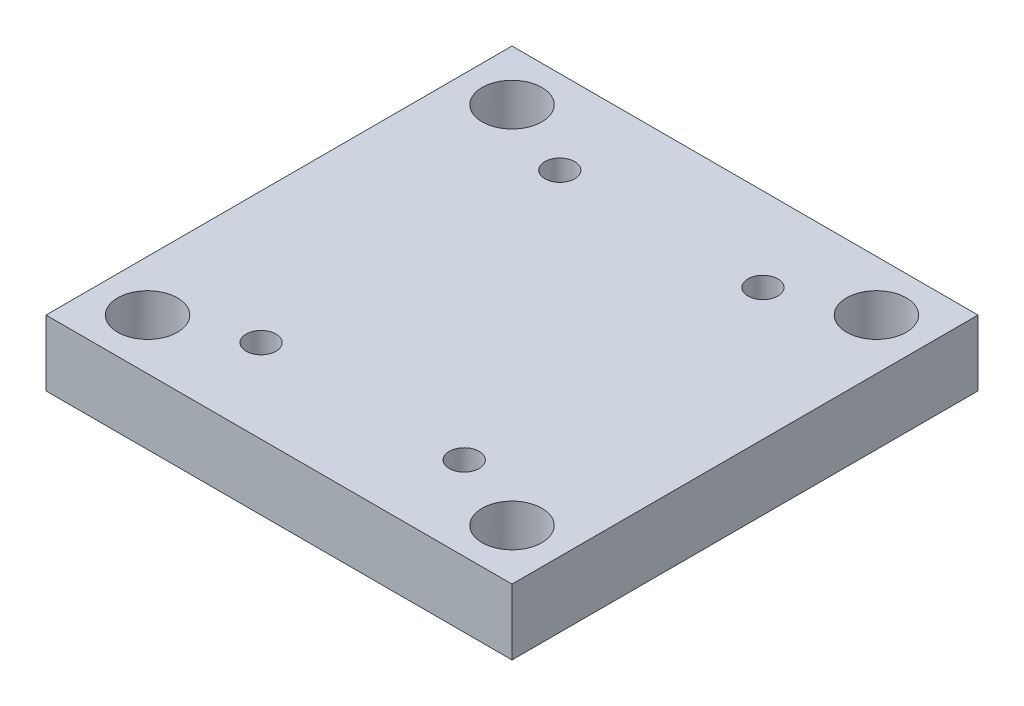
from build123d import *

# Parameters (mm, degrees)
ESBO_O1_W       = 156
ESBO_O1_H       = 156
EXTRUS_O1_DEPTH = 22
ESBO_O2_R       = 10
EXTRUS_O2_DEPTH = 113.481109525
ESBO_O3_R       = 12.5
EXTRUS_O3_DEPTH = 6
ESBO_O4_R       = 5
EXTRUS_O4_DEPTH = 113.481109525


with BuildPart() as part:
    # Esbo_o1 → Extrus_o1 (new body)
    with BuildSketch(Plane(origin=(0, 0, 0), x_dir=(1, 0, 0), z_dir=(0, 1, 0))):
        Rectangle(ESBO_O1_W, ESBO_O1_H)
    extrude(amount=EXTRUS_O1_DEPTH)

    # Esbo_o2 → Extrus_o2 (cut, through all)
    with BuildSketch(Plane(origin=(0, 22, 0), x_dir=(1, 0, 0), z_dir=(0, 1, 0))):
        with Locations(Location((61, -61, 0), (0, 0, 270))):
            Circle(ESBO_O2_R)
        with Locations(Location((-61, -61, 0), (0, 0, 270))):
            Circle(ESBO_O2_R)
        with Locations(Location((-61, 61, 0), (0, 0, 270))):
            Circle(ESBO_O2_R)
        with Locations(Location((61, 61, 0), (0, 0, 270))):
            Circle(ESBO_O2_R)
    extrude(amount=-EXTRUS_O2_DEPTH, mode=Mode.SUBTRACT)

    # Esbo_o3 → Extrus_o3 (cut)
    with BuildSketch(Plane.XZ):
        with Locations(Location((61, 61, 0), (0, 0, 270))):
            Circle(ESBO_O3_R)
        with Locations(Location((-61, 61, 0), (0, 0, 270))):
            Circle(ESBO_O3_R)
        with Locations(Location((-61, -61, 0), (0, 0, 270))):
            Circle(ESBO_O3_R)
        with Locations(Location((61, -61, 0), (0, 0, 270))):
            Circle(ESBO_O3_R)
    extrude(amount=-EXTRUS_O3_DEPTH, mode=Mode.SUBTRACT)

    # Esbo_o4 → Extrus_o4 (cut, through all)
    with BuildSketch(Plane.XZ):
        with Locations(Location((34, -50, 0), (0, 0, 270))):
            Circle(ESBO_O4_R)
        with Locations(Location((-34, -50, 0), (0, 0, 270))):
            Circle(ESBO_O4_R)
        with Locations(Location((34, 50, 0), (0, 0, 270))):
            Circle(ESBO_O4_R)
        with Locations(Location((-34, 50, 0), (0, 0, 270))):
            Circle(ESBO_O4_R)
    extrude(amount=-EXTRUS_O4_DEPTH, mode=Mode.SUBTRACT)


solid = part.part
